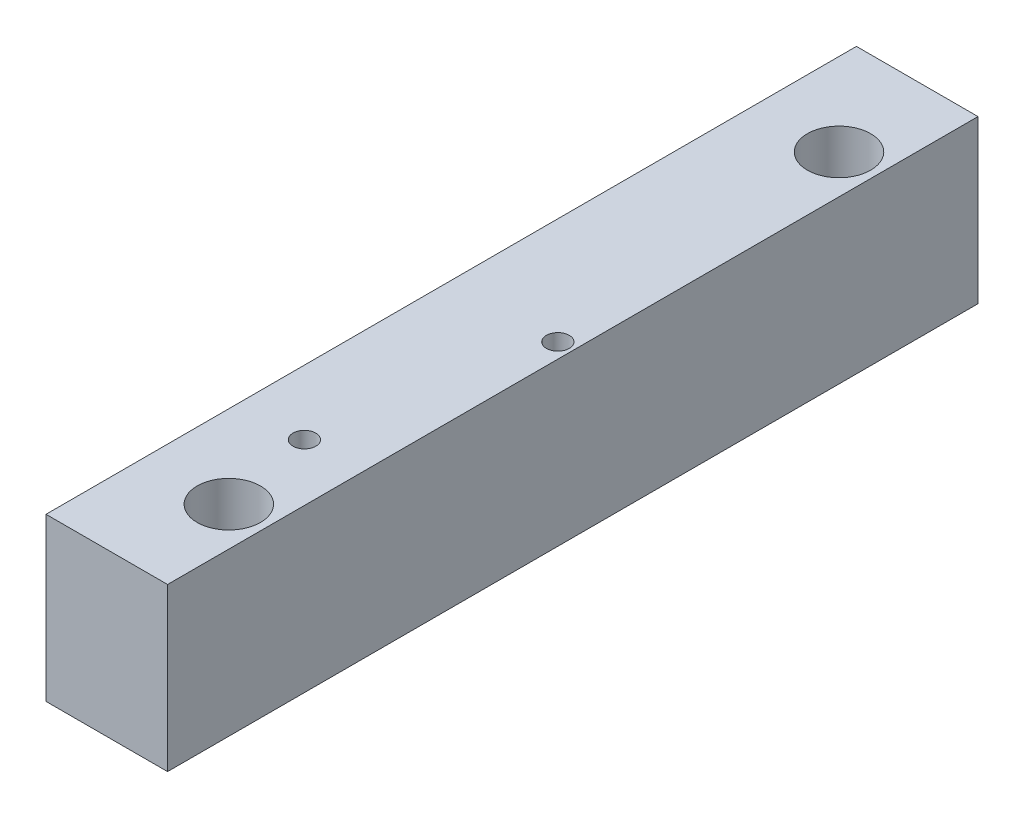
from build123d import *

# Parameters (mm, degrees)
SKETCH1_W                           = 38.1
SKETCH1_H                           = 50.8
BOSS_EXTRUDE1_DEPTH                 = 127
F_25_32_0_78125_DIAMETER_HOLE1_D    = 19.84375
F_9_32_0_28125_DIAMETER_HOLE1_D     = 7.14375
F_9_32_0_28125_DIAMETER_HOLE1_DEPTH = 50.8


with BuildPart() as part:
    # Sketch1 → Boss-Extrude1 (new, symmetric)
    with BuildSketch(Plane.XY):
        Rectangle(SKETCH1_W, SKETCH1_H)
    extrude(amount=BOSS_EXTRUDE1_DEPTH, both=True)

    # 25_32 _0.78125_ Diameter Hole1 (through all)
    with Locations(Plane(origin=(0, 25.4, 0), x_dir=(1, 0, 0), z_dir=(0, 1, 0))):
        with Locations((6.868604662, 95.619945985), (6.868604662, -95.619945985)):
            Hole(F_25_32_0_78125_DIAMETER_HOLE1_D / 2)

    # 9_32 _0.28125_ Diameter Hole1
    with Locations(Plane(origin=(0, 25.4, 0), x_dir=(1, 0, 0), z_dir=(0, 1, 0))):
        with Locations((1.186204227, -66.247744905), (14.3637, 0), (-65.772745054, 146.025967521)):
            Hole(F_9_32_0_28125_DIAMETER_HOLE1_D / 2, depth=F_9_32_0_28125_DIAMETER_HOLE1_DEPTH)


solid = part.part
